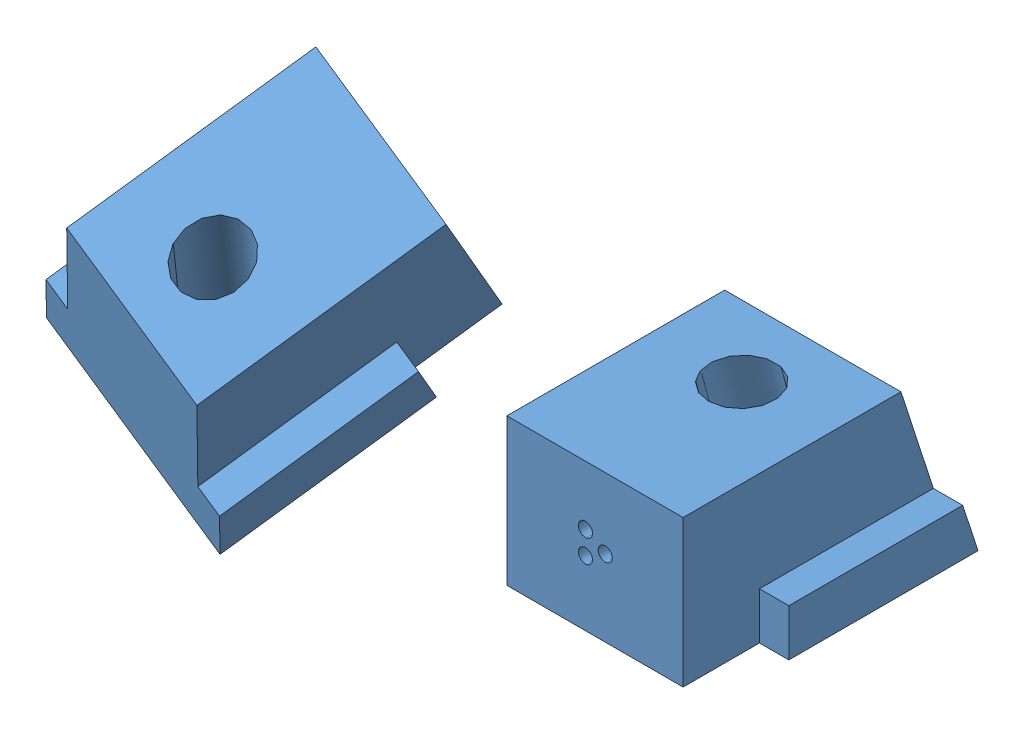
SolidWorks assembly Coloriage tiroir.SLDASM, configuration Défaut (file format 4400). Lengths in mm.
Overall size (118.24 54.49 61.64).
2 component instances, 1 part files, 0 mates.
Components (placement in the parent):
- Tiroircoloriage-1: Tiroircoloriage.SLDPRT [Défaut] at (24.8239 1.3107 0) size (40 25 45.21)
- Tiroircoloriage-2: Tiroircoloriage.SLDPRT [Défaut] at (-88.3266 29.8967 -78.2665) x (-0.930895 0.31061 -0.192241) z (0.327222 0.475154 -0.816795) size (40 25 45.21)
